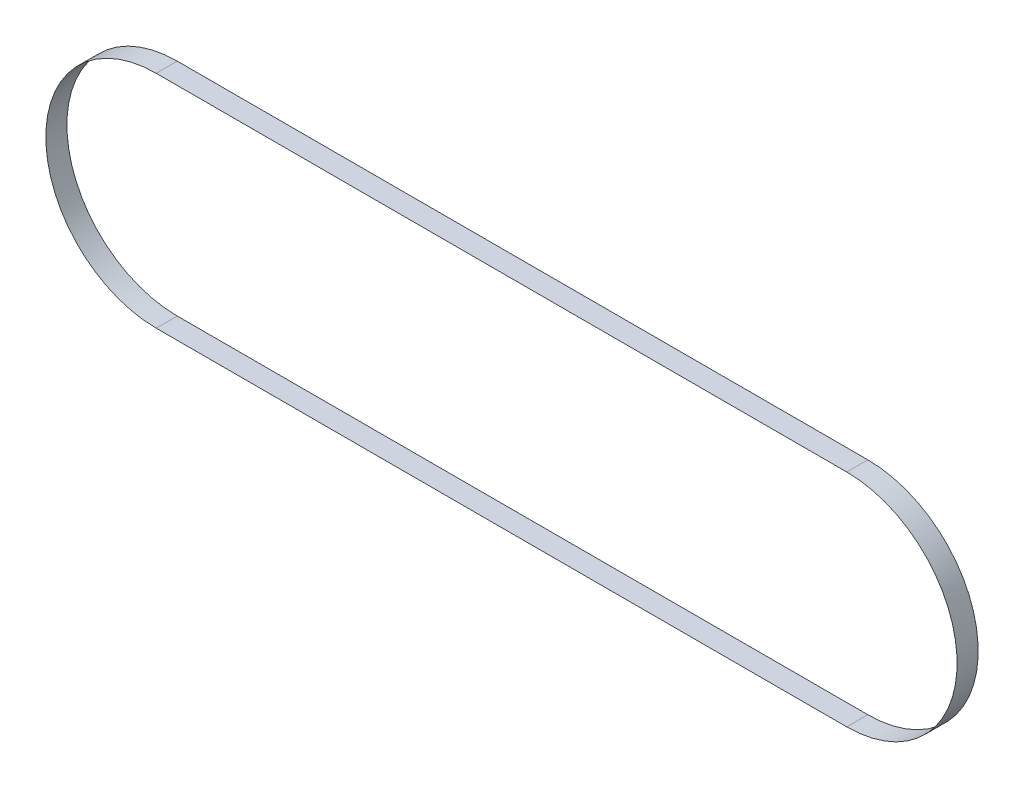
from build123d import *

# Parameters (mm, degrees)
LINEAR_AUSTRAGEN_D_NN1_DEPTH = 3.875


with BuildPart() as part:
    # Skizze2 → Linear-Austragen-D_nn1 (new, symmetric)
    with BuildSketch(Plane.XY):
        with BuildLine():
            Line((0, 40.59505), (253.982046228, 40.59505))
            ThreePointArc((253.982046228, 40.59505), (294.577096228, 0), (253.982046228, -40.59505))
            Line((253.982046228, -40.59505), (0, -40.59505))
            ThreePointArc((0, -40.59505), (-40.59505, 0), (0, 40.59505))
        make_face()
        with BuildLine():
            Line((0, 40.59495), (253.982046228, 40.59495))
            ThreePointArc((253.982046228, 40.59495), (294.576996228, 0), (253.982046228, -40.59495))
            Line((253.982046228, -40.59495), (0, -40.59495))
            ThreePointArc((0, -40.59495), (-40.59495, 0), (0, 40.59495))
        make_face(mode=Mode.SUBTRACT)
    extrude(amount=LINEAR_AUSTRAGEN_D_NN1_DEPTH, both=True)


solid = part.part
